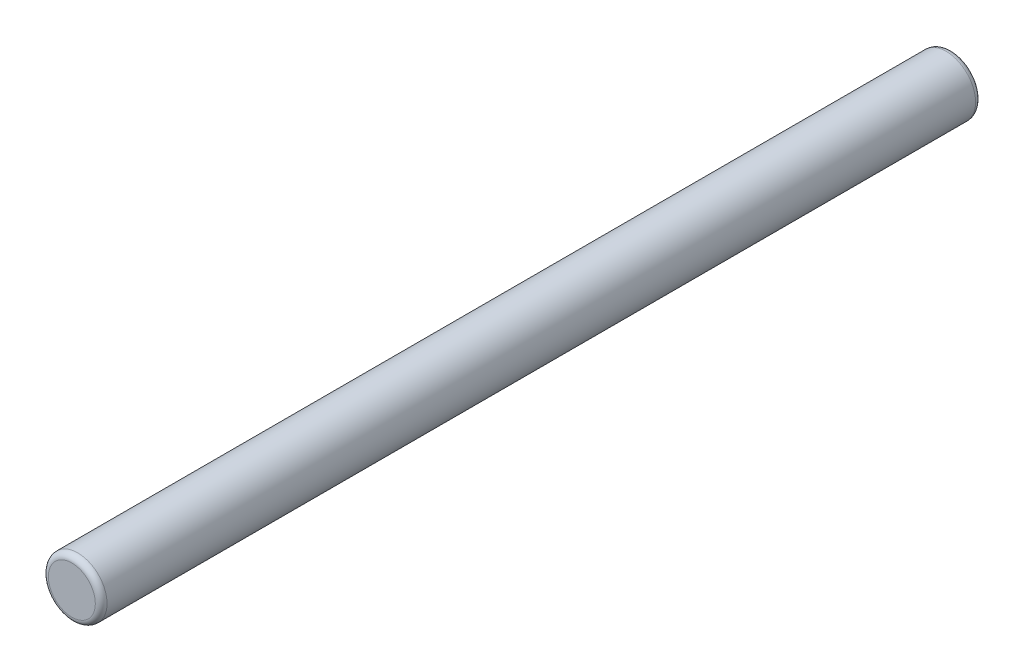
ISO-10303-21;
HEADER;
FILE_DESCRIPTION(('STEP AP214'),'2;1');
FILE_NAME('part.step','',(''),(''),'','','');
FILE_SCHEMA(('AUTOMOTIVE_DESIGN { 1 0 10303 214 1 1 1 1 }'));
ENDSEC;
DATA;
#1=APPLICATION_CONTEXT('core data for automotive mechanical design processes');
#2=APPLICATION_PROTOCOL_DEFINITION('international standard','automotive_design',2000,#1);
#3=PRODUCT_CONTEXT('',#1,'mechanical');
#4=PRODUCT('Part','Part','',(#3));
#5=PRODUCT_RELATED_PRODUCT_CATEGORY('part','',(#4));
#6=PRODUCT_DEFINITION_FORMATION('','',#4);
#7=PRODUCT_DEFINITION_CONTEXT('part definition',#1,'design');
#8=PRODUCT_DEFINITION('design','',#6,#7);
#9=PRODUCT_DEFINITION_SHAPE('','',#8);
#10=(LENGTH_UNIT() NAMED_UNIT(*) SI_UNIT(.MILLI.,.METRE.));
#11=(NAMED_UNIT(*) PLANE_ANGLE_UNIT() SI_UNIT($,.RADIAN.));
#12=(NAMED_UNIT(*) SI_UNIT($,.STERADIAN.) SOLID_ANGLE_UNIT());
#13=UNCERTAINTY_MEASURE_WITH_UNIT(LENGTH_MEASURE(1.E-05),#10,'distance_accuracy_value','');
#14=(GEOMETRIC_REPRESENTATION_CONTEXT(3) GLOBAL_UNCERTAINTY_ASSIGNED_CONTEXT((#13)) GLOBAL_UNIT_ASSIGNED_CONTEXT((#10,
#11,#12)) REPRESENTATION_CONTEXT('',''));
#15=CARTESIAN_POINT('',(0.,0.,0.));
#16=DIRECTION('',(0.,0.,1.));
#17=DIRECTION('',(1.,0.,0.));
#18=AXIS2_PLACEMENT_3D('',#15,#16,#17);
#19=CARTESIAN_POINT('',(0.,0.,30.));
#20=DIRECTION('',(0.,0.,-1.));
#21=DIRECTION('',(-1.,0.,0.));
#22=AXIS2_PLACEMENT_3D('',#19,#20,#21);
#23=CYLINDRICAL_SURFACE('',#22,1.);
#24=CARTESIAN_POINT('',(0.,0.,0.199999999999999));
#25=DIRECTION('',(0.,0.,1.));
#26=DIRECTION('',(1.,0.,0.));
#27=AXIS2_PLACEMENT_3D('',#24,#25,#26);
#28=CIRCLE('',#27,1.);
#29=CARTESIAN_POINT('',(1.,0.,0.199999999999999));
#30=VERTEX_POINT('',#29);
#31=EDGE_CURVE('E41',#30,#30,#28,.T.);
#32=ORIENTED_EDGE('',*,*,#31,.T.);
#33=EDGE_LOOP('',(#32));
#34=FACE_BOUND('',#33,.T.);
#35=CARTESIAN_POINT('',(0.,0.,29.8));
#36=DIRECTION('',(0.,0.,1.));
#37=DIRECTION('',(1.,0.,0.));
#38=AXIS2_PLACEMENT_3D('',#35,#36,#37);
#39=CIRCLE('',#38,1.);
#40=CARTESIAN_POINT('',(1.,0.,29.8));
#41=VERTEX_POINT('',#40);
#42=EDGE_CURVE('E45',#41,#41,#39,.F.);
#43=ORIENTED_EDGE('',*,*,#42,.T.);
#44=EDGE_LOOP('',(#43));
#45=FACE_BOUND('',#44,.T.);
#46=ADVANCED_FACE('F31',(#34,#45),#23,.T.);
#47=CARTESIAN_POINT('',(0.,0.,30.));
#48=DIRECTION('',(0.,0.,1.));
#49=DIRECTION('',(1.,0.,0.));
#50=AXIS2_PLACEMENT_3D('',#47,#48,#49);
#51=PLANE('',#50);
#52=CARTESIAN_POINT('',(0.,0.,30.));
#53=DIRECTION('',(0.,0.,1.));
#54=DIRECTION('',(1.,0.,0.));
#55=AXIS2_PLACEMENT_3D('',#52,#53,#54);
#56=CIRCLE('',#55,0.8);
#57=CARTESIAN_POINT('',(0.8,0.,30.));
#58=VERTEX_POINT('',#57);
#59=EDGE_CURVE('E10',#58,#58,#56,.T.);
#60=ORIENTED_EDGE('',*,*,#59,.T.);
#61=EDGE_LOOP('',(#60));
#62=FACE_BOUND('',#61,.T.);
#63=ADVANCED_FACE('F64',(#62),#51,.T.);
#64=CARTESIAN_POINT('',(0.,0.,0.));
#65=DIRECTION('',(0.,0.,1.));
#66=DIRECTION('',(1.,0.,0.));
#67=AXIS2_PLACEMENT_3D('',#64,#65,#66);
#68=PLANE('',#67);
#69=CARTESIAN_POINT('',(0.,0.,0.));
#70=DIRECTION('',(0.,0.,1.));
#71=DIRECTION('',(1.,0.,0.));
#72=AXIS2_PLACEMENT_3D('',#69,#70,#71);
#73=CIRCLE('',#72,0.8);
#74=CARTESIAN_POINT('',(0.8,0.,0.));
#75=VERTEX_POINT('',#74);
#76=EDGE_CURVE('E37',#75,#75,#73,.F.);
#77=ORIENTED_EDGE('',*,*,#76,.T.);
#78=EDGE_LOOP('',(#77));
#79=FACE_BOUND('',#78,.T.);
#80=ADVANCED_FACE('F60',(#79),#68,.F.);
#81=CARTESIAN_POINT('',(0.,0.,0.199999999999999));
#82=DIRECTION('',(0.,0.,1.));
#83=DIRECTION('',(1.,0.,0.));
#84=AXIS2_PLACEMENT_3D('',#81,#82,#83);
#85=TOROIDAL_SURFACE('',#84,0.8,0.2);
#86=ORIENTED_EDGE('',*,*,#76,.F.);
#87=EDGE_LOOP('',(#86));
#88=FACE_BOUND('',#87,.T.);
#89=ORIENTED_EDGE('',*,*,#31,.F.);
#90=EDGE_LOOP('',(#89));
#91=FACE_BOUND('',#90,.T.);
#92=ADVANCED_FACE('F55',(#88,#91),#85,.T.);
#93=CARTESIAN_POINT('',(0.,0.,29.8));
#94=DIRECTION('',(0.,0.,1.));
#95=DIRECTION('',(1.,0.,0.));
#96=AXIS2_PLACEMENT_3D('',#93,#94,#95);
#97=TOROIDAL_SURFACE('',#96,0.8,0.2);
#98=ORIENTED_EDGE('',*,*,#42,.F.);
#99=EDGE_LOOP('',(#98));
#100=FACE_BOUND('',#99,.T.);
#101=ORIENTED_EDGE('',*,*,#59,.F.);
#102=EDGE_LOOP('',(#101));
#103=FACE_BOUND('',#102,.T.);
#104=ADVANCED_FACE('F52',(#100,#103),#97,.T.);
#105=CLOSED_SHELL('',(#46,#63,#80,#92,#104));
#106=MANIFOLD_SOLID_BREP('B2',#105);
#107=ADVANCED_BREP_SHAPE_REPRESENTATION('',(#18,#106),#14);
#108=SHAPE_DEFINITION_REPRESENTATION(#9,#107);
ENDSEC;
END-ISO-10303-21;
